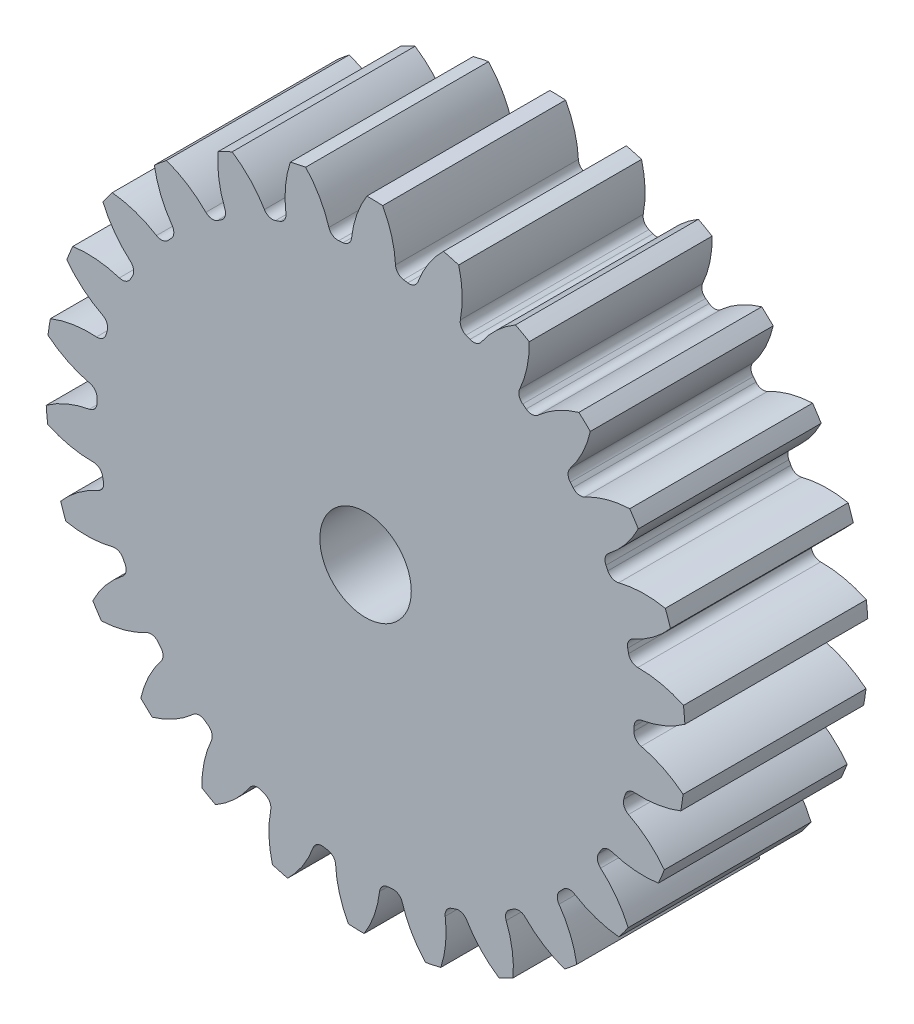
from build123d import *

# Parameters (mm, degrees)
SKETCH3_R         = 177.8
GEARBODY_DEPTH    = 101.6
TOOTHCUT_DEPTH    = 272.197787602
CIRPATTERN1_COUNT = 26
BOREDIA_R         = 25.4
BORE_DEPTH        = 12700


with BuildPart() as part:
    # Sketch3 → gearBody (new body)
    with BuildSketch(Plane.XY):
        Circle(SKETCH3_R)
    extrude(amount=GEARBODY_DEPTH)

    # Sketch2 → toothCut (cut, through all)
    with BuildSketch(Plane.XY):
        with BuildLine():
            ThreePointArc((149.122713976, -5.52420144), (149.162582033, -4.315639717), (149.19265549, -3.106794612))
            ThreePointArc((149.19265549, -3.106794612), (150.435857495, 0.149401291), (153.463550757, 1.876084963))
            ThreePointArc((153.463550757, 1.876084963), (166.227169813, 5.666571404), (177.8, 12.25044263))
            ThreePointArc((177.8, 12.25044263), (178.146982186, -5.154229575), (176.794302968, -22.509726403))
            ThreePointArc((176.794302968, -22.509726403), (165.621487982, -15.267767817), (153.09837228, -10.745674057))
            ThreePointArc((153.09837228, -10.745674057), (150.175574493, -8.84682807), (149.122713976, -5.52420144))
        make_face()
    toothcut = extrude(amount=TOOTHCUT_DEPTH, mode=Mode.SUBTRACT)

    # CirPattern1: toothCut ×26 about axis
    cirpattern1_axis = Axis((0, 0, 0), (0, 0, 1))
    for i in range(1, CIRPATTERN1_COUNT):
        add(toothcut.rotate(cirpattern1_axis, i * 360 / CIRPATTERN1_COUNT), mode=Mode.SUBTRACT)

    # boreDia → bore (cut, symmetric)
    with BuildSketch(Plane.XY):
        Circle(BOREDIA_R)
    extrude(amount=BORE_DEPTH, both=True, mode=Mode.SUBTRACT)


solid = part.part
